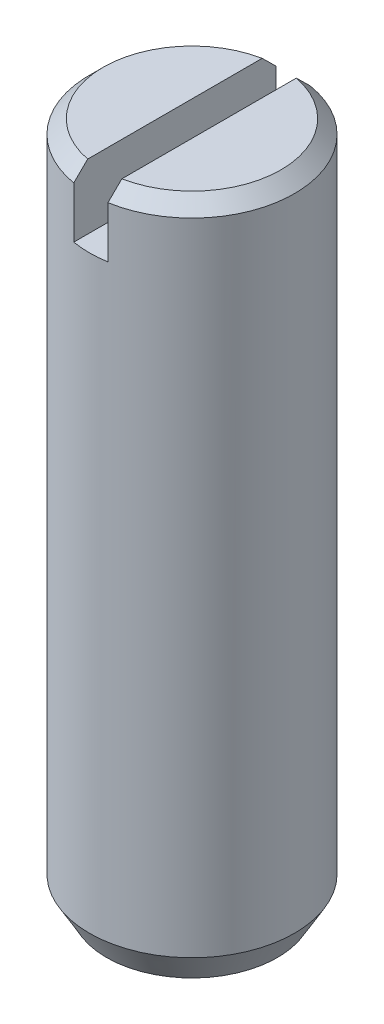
ISO-10303-21;
HEADER;
FILE_DESCRIPTION(('STEP AP214'),'2;1');
FILE_NAME('part.step','',(''),(''),'','','');
FILE_SCHEMA(('AUTOMOTIVE_DESIGN { 1 0 10303 214 1 1 1 1 }'));
ENDSEC;
DATA;
#1=APPLICATION_CONTEXT('core data for automotive mechanical design processes');
#2=APPLICATION_PROTOCOL_DEFINITION('international standard','automotive_design',2000,#1);
#3=PRODUCT_CONTEXT('',#1,'mechanical');
#4=PRODUCT('Part','Part','',(#3));
#5=PRODUCT_RELATED_PRODUCT_CATEGORY('part','',(#4));
#6=PRODUCT_DEFINITION_FORMATION('','',#4);
#7=PRODUCT_DEFINITION_CONTEXT('part definition',#1,'design');
#8=PRODUCT_DEFINITION('design','',#6,#7);
#9=PRODUCT_DEFINITION_SHAPE('','',#8);
#10=(LENGTH_UNIT() NAMED_UNIT(*) SI_UNIT(.MILLI.,.METRE.));
#11=(NAMED_UNIT(*) PLANE_ANGLE_UNIT() SI_UNIT($,.RADIAN.));
#12=(NAMED_UNIT(*) SI_UNIT($,.STERADIAN.) SOLID_ANGLE_UNIT());
#13=UNCERTAINTY_MEASURE_WITH_UNIT(LENGTH_MEASURE(1.E-05),#10,'distance_accuracy_value','');
#14=(GEOMETRIC_REPRESENTATION_CONTEXT(3) GLOBAL_UNCERTAINTY_ASSIGNED_CONTEXT((#13)) GLOBAL_UNIT_ASSIGNED_CONTEXT((#10,
#11,#12)) REPRESENTATION_CONTEXT('',''));
#15=CARTESIAN_POINT('',(0.,0.,0.));
#16=DIRECTION('',(0.,0.,1.));
#17=DIRECTION('',(1.,0.,0.));
#18=AXIS2_PLACEMENT_3D('',#15,#16,#17);
#19=CARTESIAN_POINT('',(0.,10.,0.));
#20=DIRECTION('',(0.,1.,0.));
#21=DIRECTION('',(0.,0.,1.));
#22=AXIS2_PLACEMENT_3D('',#19,#20,#21);
#23=PLANE('',#22);
#24=DIRECTION('',(0.,0.,1.));
#25=VECTOR('',#24,1.);
#26=CARTESIAN_POINT('',(-0.25,10.,0.));
#27=LINE('',#26,#25);
#28=CARTESIAN_POINT('',(-0.25,10.,-1.2757350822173));
#29=VERTEX_POINT('',#28);
#30=CARTESIAN_POINT('',(-0.25,10.,1.2757350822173));
#31=VERTEX_POINT('',#30);
#32=EDGE_CURVE('E115',#29,#31,#27,.T.);
#33=ORIENTED_EDGE('',*,*,#32,.F.);
#34=CARTESIAN_POINT('',(0.,10.,0.));
#35=DIRECTION('',(0.,1.,0.));
#36=DIRECTION('',(0.,0.,1.));
#37=AXIS2_PLACEMENT_3D('',#34,#35,#36);
#38=CIRCLE('',#37,1.3);
#39=EDGE_CURVE('E200',#29,#31,#38,.T.);
#40=ORIENTED_EDGE('',*,*,#39,.T.);
#41=EDGE_LOOP('',(#33,#40));
#42=FACE_BOUND('',#41,.T.);
#43=ADVANCED_FACE('F36',(#42),#23,.T.);
#44=CARTESIAN_POINT('',(0.,10.,0.));
#45=DIRECTION('',(0.,-1.,0.));
#46=DIRECTION('',(0.,0.,-1.));
#47=AXIS2_PLACEMENT_3D('',#44,#45,#46);
#48=CYLINDRICAL_SURFACE('',#47,1.5);
#49=CARTESIAN_POINT('',(0.,0.433012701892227,0.));
#50=DIRECTION('',(0.,1.,0.));
#51=DIRECTION('',(0.,0.,1.));
#52=AXIS2_PLACEMENT_3D('',#49,#50,#51);
#53=CIRCLE('',#52,1.5);
#54=CARTESIAN_POINT('',(0.,0.433012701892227,1.5));
#55=VERTEX_POINT('',#54);
#56=EDGE_CURVE('E44',#55,#55,#53,.T.);
#57=ORIENTED_EDGE('',*,*,#56,.T.);
#58=EDGE_LOOP('',(#57));
#59=FACE_BOUND('',#58,.T.);
#60=DIRECTION('',(0.,-1.,0.));
#61=VECTOR('',#60,1.);
#62=CARTESIAN_POINT('',(0.25,10.,-1.4790199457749));
#63=LINE('',#62,#61);
#64=CARTESIAN_POINT('',(0.25,9.04960529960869,-1.4790199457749));
#65=VERTEX_POINT('',#64);
#66=CARTESIAN_POINT('',(0.25,9.8,-1.4790199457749));
#67=VERTEX_POINT('',#66);
#68=EDGE_CURVE('E103',#65,#67,#63,.F.);
#69=ORIENTED_EDGE('',*,*,#68,.T.);
#70=CARTESIAN_POINT('',(0.,9.8,0.));
#71=DIRECTION('',(0.,1.,0.));
#72=DIRECTION('',(0.,0.,1.));
#73=AXIS2_PLACEMENT_3D('',#70,#71,#72);
#74=CIRCLE('',#73,1.5);
#75=CARTESIAN_POINT('',(0.25,9.8,1.4790199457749));
#76=VERTEX_POINT('',#75);
#77=EDGE_CURVE('E98',#67,#76,#74,.F.);
#78=ORIENTED_EDGE('',*,*,#77,.T.);
#79=DIRECTION('',(0.,-1.,0.));
#80=VECTOR('',#79,1.);
#81=CARTESIAN_POINT('',(0.25,10.,1.4790199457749));
#82=LINE('',#81,#80);
#83=CARTESIAN_POINT('',(0.25,9.04960529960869,1.4790199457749));
#84=VERTEX_POINT('',#83);
#85=EDGE_CURVE('E92',#76,#84,#82,.T.);
#86=ORIENTED_EDGE('',*,*,#85,.T.);
#87=CARTESIAN_POINT('',(0.,9.04960529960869,0.));
#88=DIRECTION('',(0.,1.,0.));
#89=DIRECTION('',(0.,0.,1.));
#90=AXIS2_PLACEMENT_3D('',#87,#88,#89);
#91=CIRCLE('',#90,1.5);
#92=CARTESIAN_POINT('',(-0.25,9.04960529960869,1.4790199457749));
#93=VERTEX_POINT('',#92);
#94=EDGE_CURVE('E96',#93,#84,#91,.T.);
#95=ORIENTED_EDGE('',*,*,#94,.F.);
#96=DIRECTION('',(0.,-1.,0.));
#97=VECTOR('',#96,1.);
#98=CARTESIAN_POINT('',(-0.25,10.,1.4790199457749));
#99=LINE('',#98,#97);
#100=CARTESIAN_POINT('',(-0.25,9.8,1.4790199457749));
#101=VERTEX_POINT('',#100);
#102=EDGE_CURVE('E102',#93,#101,#99,.F.);
#103=ORIENTED_EDGE('',*,*,#102,.T.);
#104=CARTESIAN_POINT('',(0.,9.8,0.));
#105=DIRECTION('',(0.,1.,0.));
#106=DIRECTION('',(0.,0.,1.));
#107=AXIS2_PLACEMENT_3D('',#104,#105,#106);
#108=CIRCLE('',#107,1.5);
#109=CARTESIAN_POINT('',(-0.25,9.8,-1.4790199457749));
#110=VERTEX_POINT('',#109);
#111=EDGE_CURVE('E199',#101,#110,#108,.F.);
#112=ORIENTED_EDGE('',*,*,#111,.T.);
#113=DIRECTION('',(0.,-1.,0.));
#114=VECTOR('',#113,1.);
#115=CARTESIAN_POINT('',(-0.25,10.,-1.4790199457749));
#116=LINE('',#115,#114);
#117=CARTESIAN_POINT('',(-0.25,9.04960529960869,-1.4790199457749));
#118=VERTEX_POINT('',#117);
#119=EDGE_CURVE('E124',#110,#118,#116,.T.);
#120=ORIENTED_EDGE('',*,*,#119,.T.);
#121=EDGE_CURVE('E114',#65,#118,#91,.T.);
#122=ORIENTED_EDGE('',*,*,#121,.F.);
#123=EDGE_LOOP('',(#69,#78,#86,#95,#103,#112,#120,#122));
#124=FACE_BOUND('',#123,.T.);
#125=ADVANCED_FACE('F38',(#59,#124),#48,.T.);
#126=DIRECTION('',(0.,0.,-1.));
#127=VECTOR('',#126,1.);
#128=CARTESIAN_POINT('',(0.25,10.,0.));
#129=LINE('',#128,#127);
#130=CARTESIAN_POINT('',(0.25,10.,1.2757350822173));
#131=VERTEX_POINT('',#130);
#132=CARTESIAN_POINT('',(0.25,10.,-1.2757350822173));
#133=VERTEX_POINT('',#132);
#134=EDGE_CURVE('E126',#131,#133,#129,.T.);
#135=ORIENTED_EDGE('',*,*,#134,.F.);
#136=CARTESIAN_POINT('',(0.,10.,0.));
#137=DIRECTION('',(0.,1.,0.));
#138=DIRECTION('',(0.,0.,1.));
#139=AXIS2_PLACEMENT_3D('',#136,#137,#138);
#140=CIRCLE('',#139,1.3);
#141=EDGE_CURVE('E129',#131,#133,#140,.T.);
#142=ORIENTED_EDGE('',*,*,#141,.T.);
#143=EDGE_LOOP('',(#135,#142));
#144=FACE_BOUND('',#143,.T.);
#145=ADVANCED_FACE('F185',(#144),#23,.T.);
#146=CARTESIAN_POINT('',(0.,0.,0.));
#147=DIRECTION('',(0.,1.,0.));
#148=DIRECTION('',(0.,0.,1.));
#149=AXIS2_PLACEMENT_3D('',#146,#147,#148);
#150=PLANE('',#149);
#151=CARTESIAN_POINT('',(0.,0.,0.));
#152=DIRECTION('',(0.,1.,0.));
#153=DIRECTION('',(0.,0.,1.));
#154=AXIS2_PLACEMENT_3D('',#151,#152,#153);
#155=CIRCLE('',#154,1.24999999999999);
#156=CARTESIAN_POINT('',(0.,0.,1.24999999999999));
#157=VERTEX_POINT('',#156);
#158=EDGE_CURVE('E11',#157,#157,#155,.F.);
#159=ORIENTED_EDGE('',*,*,#158,.T.);
#160=EDGE_LOOP('',(#159));
#161=FACE_BOUND('',#160,.T.);
#162=ADVANCED_FACE('F158',(#161),#150,.F.);
#163=CARTESIAN_POINT('',(-0.25,9.04960529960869,1.63700351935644));
#164=DIRECTION('',(0.,1.,0.));
#165=DIRECTION('',(0.,0.,1.));
#166=AXIS2_PLACEMENT_3D('',#163,#164,#165);
#167=PLANE('',#166);
#168=ORIENTED_EDGE('',*,*,#121,.T.);
#169=DIRECTION('',(0.,0.,1.));
#170=VECTOR('',#169,1.);
#171=CARTESIAN_POINT('',(-0.25,9.04960529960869,-1.53745600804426));
#172=LINE('',#171,#170);
#173=EDGE_CURVE('E113',#118,#93,#172,.T.);
#174=ORIENTED_EDGE('',*,*,#173,.T.);
#175=ORIENTED_EDGE('',*,*,#94,.T.);
#176=DIRECTION('',(0.,0.,-1.));
#177=VECTOR('',#176,1.);
#178=CARTESIAN_POINT('',(0.25,9.04960529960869,-1.53745600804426));
#179=LINE('',#178,#177);
#180=EDGE_CURVE('E110',#84,#65,#179,.T.);
#181=ORIENTED_EDGE('',*,*,#180,.T.);
#182=EDGE_LOOP('',(#168,#174,#175,#181));
#183=FACE_BOUND('',#182,.T.);
#184=ADVANCED_FACE('F109',(#183),#167,.T.);
#185=CARTESIAN_POINT('',(-0.25,9.04960529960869,-1.53745600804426));
#186=DIRECTION('',(-1.,0.,0.));
#187=DIRECTION('',(0.,0.,1.));
#188=AXIS2_PLACEMENT_3D('',#185,#186,#187);
#189=PLANE('',#188);
#190=ORIENTED_EDGE('',*,*,#32,.T.);
#191=CARTESIAN_POINT('',(-0.25,10.,1.2757350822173));
#192=CARTESIAN_POINT('',(-0.25,9.96670673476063,1.30965531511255));
#193=CARTESIAN_POINT('',(-0.25,9.93339343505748,1.34355583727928));
#194=CARTESIAN_POINT('',(-0.25,9.86672676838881,1.41131745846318));
#195=CARTESIAN_POINT('',(-0.25,9.83337340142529,1.44517855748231));
#196=CARTESIAN_POINT('',(-0.25,9.8,1.4790199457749));
#197=B_SPLINE_CURVE_WITH_KNOTS('',3,(#191,#192,#193,#194,#195,#196),.UNSPECIFIED.,.F.,.F.,(4,2,
4),(0.,0.142587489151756,0.285174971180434),.UNSPECIFIED.);
#198=EDGE_CURVE('E51',#31,#101,#197,.T.);
#199=ORIENTED_EDGE('',*,*,#198,.T.);
#200=ORIENTED_EDGE('',*,*,#102,.F.);
#201=ORIENTED_EDGE('',*,*,#173,.F.);
#202=ORIENTED_EDGE('',*,*,#119,.F.);
#203=CARTESIAN_POINT('',(-0.25,9.8,-1.4790199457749));
#204=CARTESIAN_POINT('',(-0.25,9.83337340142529,-1.44517855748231));
#205=CARTESIAN_POINT('',(-0.25,9.86672676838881,-1.41131745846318));
#206=CARTESIAN_POINT('',(-0.25,9.93339343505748,-1.34355583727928));
#207=CARTESIAN_POINT('',(-0.25,9.96670673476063,-1.30965531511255));
#208=CARTESIAN_POINT('',(-0.25,10.,-1.2757350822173));
#209=B_SPLINE_CURVE_WITH_KNOTS('',3,(#203,#204,#205,#206,#207,#208),.UNSPECIFIED.,.F.,.F.,(4,2,
4),(0.,0.142587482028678,0.285174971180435),.UNSPECIFIED.);
#210=EDGE_CURVE('E59',#110,#29,#209,.T.);
#211=ORIENTED_EDGE('',*,*,#210,.T.);
#212=EDGE_LOOP('',(#190,#199,#200,#201,#202,#211));
#213=FACE_BOUND('',#212,.T.);
#214=ADVANCED_FACE('F153',(#213),#189,.F.);
#215=CARTESIAN_POINT('',(0.25,9.04960529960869,-1.53745600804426));
#216=DIRECTION('',(1.,0.,0.));
#217=DIRECTION('',(0.,0.,-1.));
#218=AXIS2_PLACEMENT_3D('',#215,#216,#217);
#219=PLANE('',#218);
#220=ORIENTED_EDGE('',*,*,#134,.T.);
#221=CARTESIAN_POINT('',(0.25,10.,-1.2757350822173));
#222=CARTESIAN_POINT('',(0.25,9.96670673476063,-1.30965531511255));
#223=CARTESIAN_POINT('',(0.25,9.93339343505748,-1.34355583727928));
#224=CARTESIAN_POINT('',(0.25,9.86672676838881,-1.41131745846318));
#225=CARTESIAN_POINT('',(0.25,9.83337340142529,-1.44517855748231));
#226=CARTESIAN_POINT('',(0.25,9.8,-1.4790199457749));
#227=B_SPLINE_CURVE_WITH_KNOTS('',3,(#221,#222,#223,#224,#225,#226),.UNSPECIFIED.,.F.,.F.,(4,2,
4),(0.,0.142587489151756,0.285174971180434),.UNSPECIFIED.);
#228=EDGE_CURVE('E140',#133,#67,#227,.T.);
#229=ORIENTED_EDGE('',*,*,#228,.T.);
#230=ORIENTED_EDGE('',*,*,#68,.F.);
#231=ORIENTED_EDGE('',*,*,#180,.F.);
#232=ORIENTED_EDGE('',*,*,#85,.F.);
#233=CARTESIAN_POINT('',(0.25,9.8,1.4790199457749));
#234=CARTESIAN_POINT('',(0.25,9.83337340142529,1.44517855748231));
#235=CARTESIAN_POINT('',(0.25,9.86672676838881,1.41131745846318));
#236=CARTESIAN_POINT('',(0.25,9.93339343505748,1.34355583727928));
#237=CARTESIAN_POINT('',(0.25,9.96670673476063,1.30965531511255));
#238=CARTESIAN_POINT('',(0.25,10.,1.2757350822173));
#239=B_SPLINE_CURVE_WITH_KNOTS('',3,(#233,#234,#235,#236,#237,#238),.UNSPECIFIED.,.F.,.F.,(4,2,
4),(0.,0.142587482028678,0.285174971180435),.UNSPECIFIED.);
#240=EDGE_CURVE('E132',#76,#131,#239,.T.);
#241=ORIENTED_EDGE('',*,*,#240,.T.);
#242=EDGE_LOOP('',(#220,#229,#230,#231,#232,#241));
#243=FACE_BOUND('',#242,.T.);
#244=ADVANCED_FACE('F118',(#243),#219,.F.);
#245=CARTESIAN_POINT('',(0.,10.,0.));
#246=DIRECTION('',(0.,-1.,0.));
#247=DIRECTION('',(0.,0.,-1.));
#248=AXIS2_PLACEMENT_3D('',#245,#246,#247);
#249=CONICAL_SURFACE('',#248,1.3,0.785398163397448);
#250=ORIENTED_EDGE('',*,*,#240,.F.);
#251=ORIENTED_EDGE('',*,*,#77,.F.);
#252=ORIENTED_EDGE('',*,*,#228,.F.);
#253=ORIENTED_EDGE('',*,*,#141,.F.);
#254=EDGE_LOOP('',(#250,#251,#252,#253));
#255=FACE_BOUND('',#254,.T.);
#256=ADVANCED_FACE('F146',(#255),#249,.T.);
#257=CARTESIAN_POINT('',(0.,10.,0.));
#258=DIRECTION('',(0.,-1.,0.));
#259=DIRECTION('',(0.,0.,-1.));
#260=AXIS2_PLACEMENT_3D('',#257,#258,#259);
#261=CONICAL_SURFACE('',#260,1.3,0.785398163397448);
#262=ORIENTED_EDGE('',*,*,#210,.F.);
#263=ORIENTED_EDGE('',*,*,#111,.F.);
#264=ORIENTED_EDGE('',*,*,#198,.F.);
#265=ORIENTED_EDGE('',*,*,#39,.F.);
#266=EDGE_LOOP('',(#262,#263,#264,#265));
#267=FACE_BOUND('',#266,.T.);
#268=ADVANCED_FACE('F171',(#267),#261,.T.);
#269=CARTESIAN_POINT('',(0.,0.433012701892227,0.));
#270=DIRECTION('',(0.,1.,0.));
#271=DIRECTION('',(0.,0.,1.));
#272=AXIS2_PLACEMENT_3D('',#269,#270,#271);
#273=CONICAL_SURFACE('',#272,1.5,0.523598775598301);
#274=ORIENTED_EDGE('',*,*,#158,.F.);
#275=EDGE_LOOP('',(#274));
#276=FACE_BOUND('',#275,.T.);
#277=ORIENTED_EDGE('',*,*,#56,.F.);
#278=EDGE_LOOP('',(#277));
#279=FACE_BOUND('',#278,.T.);
#280=ADVANCED_FACE('F175',(#276,#279),#273,.T.);
#281=CLOSED_SHELL('',(#43,#125,#145,#162,#184,#214,#244,#256,#268,#280));
#282=MANIFOLD_SOLID_BREP('B2',#281);
#283=ADVANCED_BREP_SHAPE_REPRESENTATION('',(#18,#282),#14);
#284=SHAPE_DEFINITION_REPRESENTATION(#9,#283);
ENDSEC;
END-ISO-10303-21;
